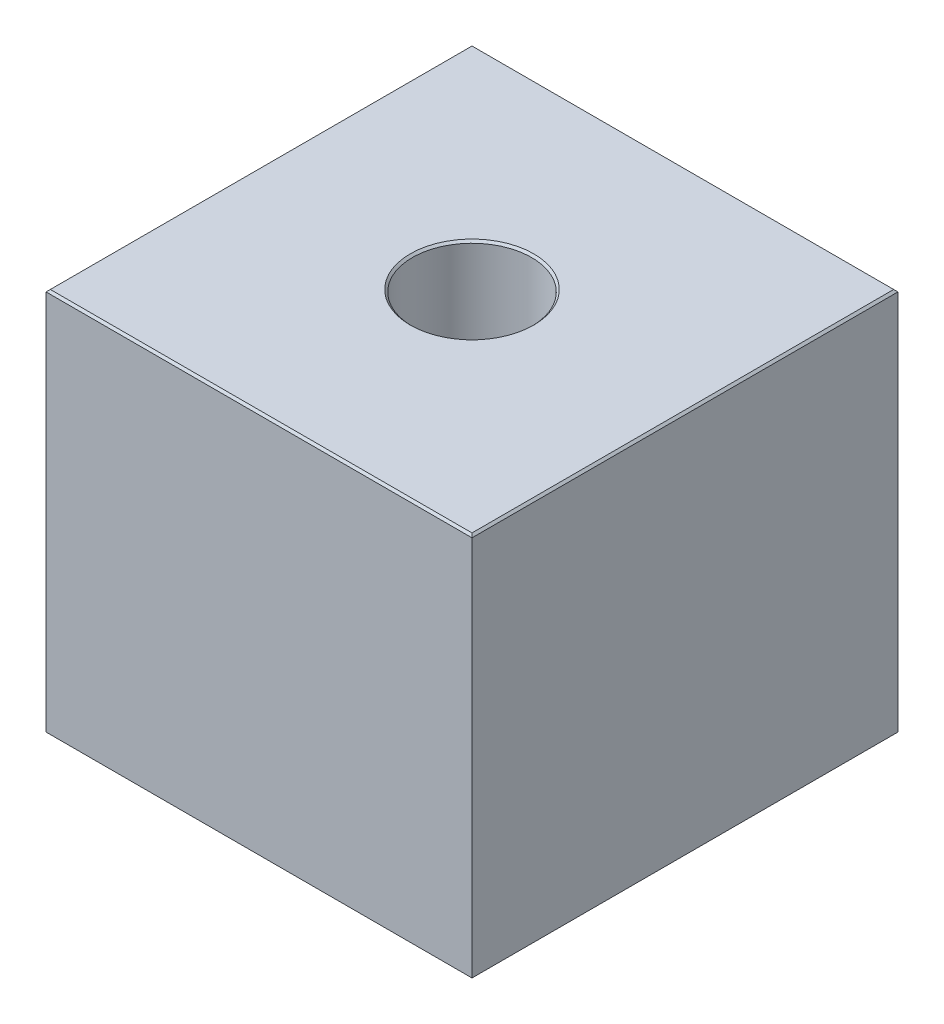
from build123d import *

# Parameters (mm, degrees)
ESQUISSE1_W             = 100
ESQUISSE1_H             = 90
EXTRUSION1_DEPTH        = 100
ESQUISSE2_R             = 14
ENL_V_MAT_EXTRU_1_DEPTH = 168.630546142
CHANFREIN3_SIZE         = 0.5


with BuildPart() as part:
    # Esquisse1 → Extrusion1 (new body)
    with BuildSketch(Plane.XY):
        with Locations((50, 45)):
            Rectangle(ESQUISSE1_W, ESQUISSE1_H)
    extrude(amount=EXTRUSION1_DEPTH)

    # Esquisse2 → Enl_v. mat.-Extru.1 (cut, through all)
    with BuildSketch(Plane(origin=(0, 90, 0), x_dir=(-1, 0, 0), z_dir=(0, 1, 0))):
        with Locations(Location((-50, 50, 0), (0, 0, 90))):
            Circle(ESQUISSE2_R)
    extrude(amount=-ENL_V_MAT_EXTRU_1_DEPTH, mode=Mode.SUBTRACT)

    # Chanfrein3
    chanfrein3_edges = [part.edges().sort_by_distance(p)[0] for p in [
        (50, 90, 100),
        (50, 90, 36),
        (50, 90, 0),
        (0, 90, 50),
        (100, 90, 50),
    ]]
    chamfer(chanfrein3_edges, length=CHANFREIN3_SIZE)


solid = part.part
